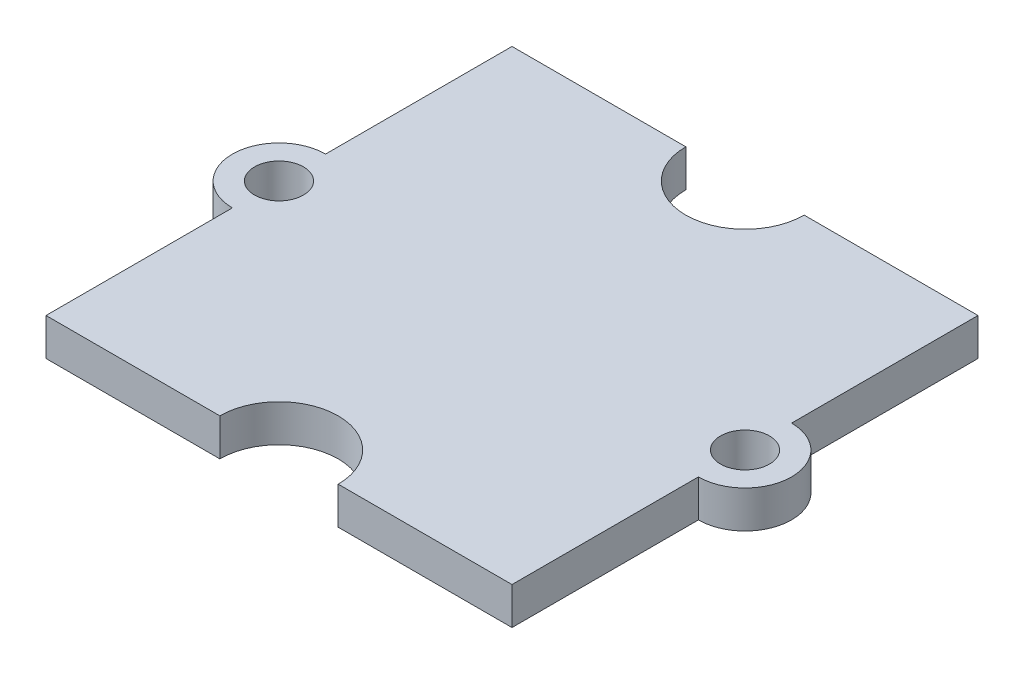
from build123d import *

# Parameters (mm, degrees)
ESQUISSE1_R        = 1.05
BOSS_EXTRU_1_DEPTH = 1.6


with BuildPart() as part:
    # Esquisse1 → Boss.-Extru.1 (new body)
    with BuildSketch(Plane(origin=(0, 0, 0), x_dir=(1, 0, 0), z_dir=(0, 1, 0))):
        with BuildLine():
            Line((10, -2), (10, -10))
            Line((10, -10), (2.54, -10))
            ThreePointArc((2.54, -10), (0, -7.46), (-2.54, -10))
            Line((-2.54, -10), (-10, -10))
            Line((-10, -10), (-10, -2))
            ThreePointArc((-10, -2), (-12, 0), (-10, 2))
            Line((-10, 2), (-10, 10))
            Line((-10, 10), (-2.54, 10))
            ThreePointArc((-2.54, 10), (0, 7.46), (2.54, 10))
            Line((2.54, 10), (10, 10))
            Line((10, 10), (10, 2))
            ThreePointArc((10, 2), (12, 0), (10, -2))
        make_face()
        with Locations(Location((10, 0, 0), (0, 0, 270))):
            Circle(ESQUISSE1_R, mode=Mode.SUBTRACT)
        with Locations(Location((-10, 0, 0), (0, 0, 90))):
            Circle(ESQUISSE1_R, mode=Mode.SUBTRACT)
    extrude(amount=BOSS_EXTRU_1_DEPTH)


solid = part.part
